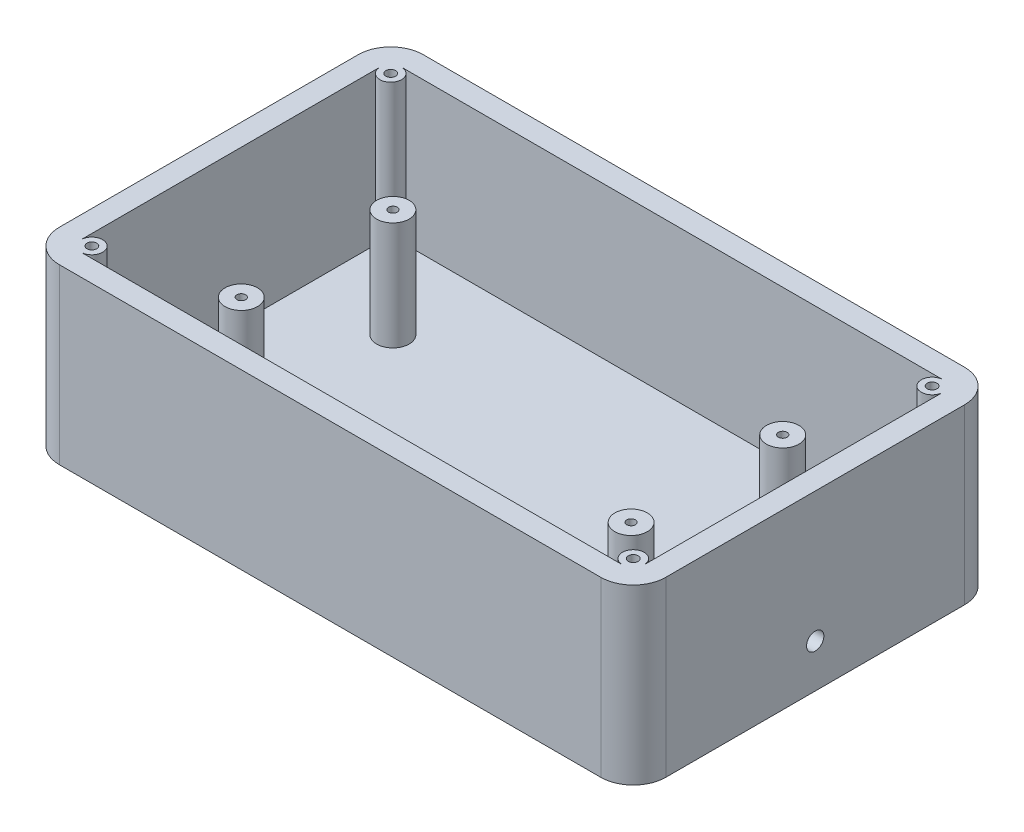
ISO-10303-21;
HEADER;
FILE_DESCRIPTION(('STEP AP214'),'2;1');
FILE_NAME('part.step','',(''),(''),'','','');
FILE_SCHEMA(('AUTOMOTIVE_DESIGN { 1 0 10303 214 1 1 1 1 }'));
ENDSEC;
DATA;
#1=APPLICATION_CONTEXT('core data for automotive mechanical design processes');
#2=APPLICATION_PROTOCOL_DEFINITION('international standard','automotive_design',2000,#1);
#3=PRODUCT_CONTEXT('',#1,'mechanical');
#4=PRODUCT('Part','Part','',(#3));
#5=PRODUCT_RELATED_PRODUCT_CATEGORY('part','',(#4));
#6=PRODUCT_DEFINITION_FORMATION('','',#4);
#7=PRODUCT_DEFINITION_CONTEXT('part definition',#1,'design');
#8=PRODUCT_DEFINITION('design','',#6,#7);
#9=PRODUCT_DEFINITION_SHAPE('','',#8);
#10=(LENGTH_UNIT() NAMED_UNIT(*) SI_UNIT(.MILLI.,.METRE.));
#11=(NAMED_UNIT(*) PLANE_ANGLE_UNIT() SI_UNIT($,.RADIAN.));
#12=(NAMED_UNIT(*) SI_UNIT($,.STERADIAN.) SOLID_ANGLE_UNIT());
#13=UNCERTAINTY_MEASURE_WITH_UNIT(LENGTH_MEASURE(1.E-05),#10,'distance_accuracy_value','');
#14=(GEOMETRIC_REPRESENTATION_CONTEXT(3) GLOBAL_UNCERTAINTY_ASSIGNED_CONTEXT((#13)) GLOBAL_UNIT_ASSIGNED_CONTEXT((#10,
#11,#12)) REPRESENTATION_CONTEXT('',''));
#15=CARTESIAN_POINT('',(0.,0.,0.));
#16=DIRECTION('',(0.,0.,1.));
#17=DIRECTION('',(1.,0.,0.));
#18=AXIS2_PLACEMENT_3D('',#15,#16,#17);
#19=CARTESIAN_POINT('',(88.9,-50.8,53.34));
#20=DIRECTION('',(1.,0.,0.));
#21=DIRECTION('',(0.,0.,-1.));
#22=AXIS2_PLACEMENT_3D('',#19,#20,#21);
#23=PLANE('',#22);
#24=CARTESIAN_POINT('',(88.9,-38.1,0.));
#25=DIRECTION('',(1.,0.,0.));
#26=DIRECTION('',(0.,0.,-1.));
#27=AXIS2_PLACEMENT_3D('',#24,#25,#26);
#28=CIRCLE('',#27,2.54);
#29=CARTESIAN_POINT('',(88.9,-38.1,-2.54));
#30=VERTEX_POINT('',#29);
#31=EDGE_CURVE('E237',#30,#30,#28,.T.);
#32=ORIENTED_EDGE('',*,*,#31,.F.);
#33=EDGE_LOOP('',(#32));
#34=FACE_BOUND('',#33,.T.);
#35=DIRECTION('',(0.,0.,-1.));
#36=VECTOR('',#35,1.);
#37=CARTESIAN_POINT('',(88.9,0.,53.34));
#38=LINE('',#37,#36);
#39=CARTESIAN_POINT('',(88.9,0.,43.815));
#40=VERTEX_POINT('',#39);
#41=CARTESIAN_POINT('',(88.9,0.,-43.815));
#42=VERTEX_POINT('',#41);
#43=EDGE_CURVE('E355',#40,#42,#38,.T.);
#44=ORIENTED_EDGE('',*,*,#43,.F.);
#45=DIRECTION('',(0.,1.,0.));
#46=VECTOR('',#45,1.);
#47=CARTESIAN_POINT('',(88.9,-50.8,43.815));
#48=LINE('',#47,#46);
#49=CARTESIAN_POINT('',(88.9,-50.8,43.815));
#50=VERTEX_POINT('',#49);
#51=EDGE_CURVE('E403',#40,#50,#48,.F.);
#52=ORIENTED_EDGE('',*,*,#51,.T.);
#53=DIRECTION('',(0.,0.,-1.));
#54=VECTOR('',#53,1.);
#55=CARTESIAN_POINT('',(88.9,-50.8,53.34));
#56=LINE('',#55,#54);
#57=CARTESIAN_POINT('',(88.9,-50.8,-43.815));
#58=VERTEX_POINT('',#57);
#59=EDGE_CURVE('E365',#50,#58,#56,.T.);
#60=ORIENTED_EDGE('',*,*,#59,.T.);
#61=DIRECTION('',(0.,1.,0.));
#62=VECTOR('',#61,1.);
#63=CARTESIAN_POINT('',(88.9,-50.8,-43.815));
#64=LINE('',#63,#62);
#65=EDGE_CURVE('E400',#58,#42,#64,.T.);
#66=ORIENTED_EDGE('',*,*,#65,.T.);
#67=EDGE_LOOP('',(#44,#52,#60,#66));
#68=FACE_BOUND('',#67,.T.);
#69=ADVANCED_FACE('F52',(#34,#68),#23,.T.);
#70=CARTESIAN_POINT('',(-88.9,-50.8,53.34));
#71=DIRECTION('',(0.,0.,1.));
#72=DIRECTION('',(1.,0.,0.));
#73=AXIS2_PLACEMENT_3D('',#70,#71,#72);
#74=PLANE('',#73);
#75=DIRECTION('',(1.,0.,0.));
#76=VECTOR('',#75,1.);
#77=CARTESIAN_POINT('',(-88.9,-50.8,53.34));
#78=LINE('',#77,#76);
#79=CARTESIAN_POINT('',(-79.375,-50.8,53.34));
#80=VERTEX_POINT('',#79);
#81=CARTESIAN_POINT('',(79.375,-50.8,53.34));
#82=VERTEX_POINT('',#81);
#83=EDGE_CURVE('E374',#80,#82,#78,.T.);
#84=ORIENTED_EDGE('',*,*,#83,.T.);
#85=DIRECTION('',(0.,1.,0.));
#86=VECTOR('',#85,1.);
#87=CARTESIAN_POINT('',(79.375,-50.8,53.34));
#88=LINE('',#87,#86);
#89=CARTESIAN_POINT('',(79.375,0.,53.34));
#90=VERTEX_POINT('',#89);
#91=EDGE_CURVE('E389',#82,#90,#88,.T.);
#92=ORIENTED_EDGE('',*,*,#91,.T.);
#93=DIRECTION('',(1.,0.,0.));
#94=VECTOR('',#93,1.);
#95=CARTESIAN_POINT('',(-88.9,0.,53.34));
#96=LINE('',#95,#94);
#97=CARTESIAN_POINT('',(-79.375,0.,53.34));
#98=VERTEX_POINT('',#97);
#99=EDGE_CURVE('E369',#98,#90,#96,.T.);
#100=ORIENTED_EDGE('',*,*,#99,.F.);
#101=DIRECTION('',(0.,1.,0.));
#102=VECTOR('',#101,1.);
#103=CARTESIAN_POINT('',(-79.375,-50.8,53.34));
#104=LINE('',#103,#102);
#105=EDGE_CURVE('E377',#98,#80,#104,.F.);
#106=ORIENTED_EDGE('',*,*,#105,.T.);
#107=EDGE_LOOP('',(#84,#92,#100,#106));
#108=FACE_BOUND('',#107,.T.);
#109=ADVANCED_FACE('F451',(#108),#74,.T.);
#110=CARTESIAN_POINT('',(-88.9,-50.8,53.34));
#111=DIRECTION('',(-1.,0.,0.));
#112=DIRECTION('',(0.,0.,1.));
#113=AXIS2_PLACEMENT_3D('',#110,#111,#112);
#114=PLANE('',#113);
#115=CARTESIAN_POINT('',(-88.9,-38.1,0.));
#116=DIRECTION('',(-1.,0.,0.));
#117=DIRECTION('',(0.,0.,1.));
#118=AXIS2_PLACEMENT_3D('',#115,#116,#117);
#119=CIRCLE('',#118,2.667);
#120=CARTESIAN_POINT('',(-88.9,-38.1,2.667));
#121=VERTEX_POINT('',#120);
#122=EDGE_CURVE('E240',#121,#121,#119,.T.);
#123=ORIENTED_EDGE('',*,*,#122,.F.);
#124=EDGE_LOOP('',(#123));
#125=FACE_BOUND('',#124,.T.);
#126=DIRECTION('',(0.,0.,1.));
#127=VECTOR('',#126,1.);
#128=CARTESIAN_POINT('',(-88.9,0.,53.34));
#129=LINE('',#128,#127);
#130=CARTESIAN_POINT('',(-88.9,0.,-43.815));
#131=VERTEX_POINT('',#130);
#132=CARTESIAN_POINT('',(-88.9,0.,43.815));
#133=VERTEX_POINT('',#132);
#134=EDGE_CURVE('E383',#131,#133,#129,.T.);
#135=ORIENTED_EDGE('',*,*,#134,.F.);
#136=DIRECTION('',(0.,1.,0.));
#137=VECTOR('',#136,1.);
#138=CARTESIAN_POINT('',(-88.9,-50.8,-43.815));
#139=LINE('',#138,#137);
#140=CARTESIAN_POINT('',(-88.9,-50.8,-43.815));
#141=VERTEX_POINT('',#140);
#142=EDGE_CURVE('E420',#131,#141,#139,.F.);
#143=ORIENTED_EDGE('',*,*,#142,.T.);
#144=DIRECTION('',(0.,0.,1.));
#145=VECTOR('',#144,1.);
#146=CARTESIAN_POINT('',(-88.9,-50.8,53.34));
#147=LINE('',#146,#145);
#148=CARTESIAN_POINT('',(-88.9,-50.8,43.815));
#149=VERTEX_POINT('',#148);
#150=EDGE_CURVE('E371',#141,#149,#147,.T.);
#151=ORIENTED_EDGE('',*,*,#150,.T.);
#152=DIRECTION('',(0.,1.,0.));
#153=VECTOR('',#152,1.);
#154=CARTESIAN_POINT('',(-88.9,-50.8,43.815));
#155=LINE('',#154,#153);
#156=EDGE_CURVE('E417',#149,#133,#155,.T.);
#157=ORIENTED_EDGE('',*,*,#156,.T.);
#158=EDGE_LOOP('',(#135,#143,#151,#157));
#159=FACE_BOUND('',#158,.T.);
#160=ADVANCED_FACE('F457',(#125,#159),#114,.T.);
#161=CARTESIAN_POINT('',(-88.9,-50.8,-53.34));
#162=DIRECTION('',(0.,0.,-1.));
#163=DIRECTION('',(-1.,0.,0.));
#164=AXIS2_PLACEMENT_3D('',#161,#162,#163);
#165=PLANE('',#164);
#166=DIRECTION('',(-1.,0.,0.));
#167=VECTOR('',#166,1.);
#168=CARTESIAN_POINT('',(-88.9,0.,-53.34));
#169=LINE('',#168,#167);
#170=CARTESIAN_POINT('',(79.375,0.,-53.34));
#171=VERTEX_POINT('',#170);
#172=CARTESIAN_POINT('',(-79.375,0.,-53.34));
#173=VERTEX_POINT('',#172);
#174=EDGE_CURVE('E380',#171,#173,#169,.T.);
#175=ORIENTED_EDGE('',*,*,#174,.F.);
#176=DIRECTION('',(0.,1.,0.));
#177=VECTOR('',#176,1.);
#178=CARTESIAN_POINT('',(79.375,-50.8,-53.34));
#179=LINE('',#178,#177);
#180=CARTESIAN_POINT('',(79.375,-50.8,-53.34));
#181=VERTEX_POINT('',#180);
#182=EDGE_CURVE('E415',#171,#181,#179,.F.);
#183=ORIENTED_EDGE('',*,*,#182,.T.);
#184=DIRECTION('',(-1.,0.,0.));
#185=VECTOR('',#184,1.);
#186=CARTESIAN_POINT('',(-88.9,-50.8,-53.34));
#187=LINE('',#186,#185);
#188=CARTESIAN_POINT('',(-79.375,-50.8,-53.34));
#189=VERTEX_POINT('',#188);
#190=EDGE_CURVE('E368',#181,#189,#187,.T.);
#191=ORIENTED_EDGE('',*,*,#190,.T.);
#192=DIRECTION('',(0.,1.,0.));
#193=VECTOR('',#192,1.);
#194=CARTESIAN_POINT('',(-79.375,-50.8,-53.34));
#195=LINE('',#194,#193);
#196=EDGE_CURVE('E412',#189,#173,#195,.T.);
#197=ORIENTED_EDGE('',*,*,#196,.T.);
#198=EDGE_LOOP('',(#175,#183,#191,#197));
#199=FACE_BOUND('',#198,.T.);
#200=ADVANCED_FACE('F464',(#199),#165,.T.);
#201=CARTESIAN_POINT('',(0.,-50.8,0.));
#202=DIRECTION('',(0.,-1.,0.));
#203=DIRECTION('',(0.,0.,-1.));
#204=AXIS2_PLACEMENT_3D('',#201,#202,#203);
#205=PLANE('',#204);
#206=CARTESIAN_POINT('',(-57.15,-50.8,-22.225));
#207=DIRECTION('',(0.,-1.,0.));
#208=DIRECTION('',(0.,0.,-1.));
#209=AXIS2_PLACEMENT_3D('',#206,#207,#208);
#210=CIRCLE('',#209,1.26999999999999);
#211=CARTESIAN_POINT('',(-57.15,-50.8,-23.495));
#212=VERTEX_POINT('',#211);
#213=EDGE_CURVE('E215',#212,#212,#210,.T.);
#214=ORIENTED_EDGE('',*,*,#213,.F.);
#215=EDGE_LOOP('',(#214));
#216=FACE_BOUND('',#215,.T.);
#217=CARTESIAN_POINT('',(-57.15,-50.8,22.225));
#218=DIRECTION('',(0.,-1.,0.));
#219=DIRECTION('',(0.,0.,-1.));
#220=AXIS2_PLACEMENT_3D('',#217,#218,#219);
#221=CIRCLE('',#220,1.26999999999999);
#222=CARTESIAN_POINT('',(-57.15,-50.8,20.955));
#223=VERTEX_POINT('',#222);
#224=EDGE_CURVE('E214',#223,#223,#221,.T.);
#225=ORIENTED_EDGE('',*,*,#224,.F.);
#226=EDGE_LOOP('',(#225));
#227=FACE_BOUND('',#226,.T.);
#228=CARTESIAN_POINT('',(57.15,-50.8,22.225));
#229=DIRECTION('',(0.,-1.,0.));
#230=DIRECTION('',(0.,0.,-1.));
#231=AXIS2_PLACEMENT_3D('',#228,#229,#230);
#232=CIRCLE('',#231,1.26999999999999);
#233=CARTESIAN_POINT('',(57.15,-50.8,20.955));
#234=VERTEX_POINT('',#233);
#235=EDGE_CURVE('E225',#234,#234,#232,.T.);
#236=ORIENTED_EDGE('',*,*,#235,.F.);
#237=EDGE_LOOP('',(#236));
#238=FACE_BOUND('',#237,.T.);
#239=CARTESIAN_POINT('',(57.15,-50.8,-22.225));
#240=DIRECTION('',(0.,-1.,0.));
#241=DIRECTION('',(0.,0.,-1.));
#242=AXIS2_PLACEMENT_3D('',#239,#240,#241);
#243=CIRCLE('',#242,1.26999999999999);
#244=CARTESIAN_POINT('',(57.15,-50.8,-23.495));
#245=VERTEX_POINT('',#244);
#246=EDGE_CURVE('E231',#245,#245,#243,.T.);
#247=ORIENTED_EDGE('',*,*,#246,.F.);
#248=EDGE_LOOP('',(#247));
#249=FACE_BOUND('',#248,.T.);
#250=ORIENTED_EDGE('',*,*,#59,.F.);
#251=CARTESIAN_POINT('',(79.375,-50.8,43.815));
#252=DIRECTION('',(0.,-1.,0.));
#253=DIRECTION('',(0.,0.,-1.));
#254=AXIS2_PLACEMENT_3D('',#251,#252,#253);
#255=CIRCLE('',#254,9.525);
#256=EDGE_CURVE('E410',#50,#82,#255,.T.);
#257=ORIENTED_EDGE('',*,*,#256,.T.);
#258=ORIENTED_EDGE('',*,*,#83,.F.);
#259=CARTESIAN_POINT('',(-79.375,-50.8,43.815));
#260=DIRECTION('',(0.,-1.,0.));
#261=DIRECTION('',(0.,0.,-1.));
#262=AXIS2_PLACEMENT_3D('',#259,#260,#261);
#263=CIRCLE('',#262,9.525);
#264=EDGE_CURVE('E405',#80,#149,#263,.T.);
#265=ORIENTED_EDGE('',*,*,#264,.T.);
#266=ORIENTED_EDGE('',*,*,#150,.F.);
#267=CARTESIAN_POINT('',(-79.375,-50.8,-43.815));
#268=DIRECTION('',(0.,-1.,0.));
#269=DIRECTION('',(0.,0.,-1.));
#270=AXIS2_PLACEMENT_3D('',#267,#268,#269);
#271=CIRCLE('',#270,9.525);
#272=EDGE_CURVE('E77',#141,#189,#271,.T.);
#273=ORIENTED_EDGE('',*,*,#272,.T.);
#274=ORIENTED_EDGE('',*,*,#190,.F.);
#275=CARTESIAN_POINT('',(79.375,-50.8,-43.815));
#276=DIRECTION('',(0.,-1.,0.));
#277=DIRECTION('',(0.,0.,-1.));
#278=AXIS2_PLACEMENT_3D('',#275,#276,#277);
#279=CIRCLE('',#278,9.525);
#280=EDGE_CURVE('E408',#181,#58,#279,.T.);
#281=ORIENTED_EDGE('',*,*,#280,.T.);
#282=EDGE_LOOP('',(#250,#257,#258,#265,#266,#273,#274,#281));
#283=FACE_BOUND('',#282,.T.);
#284=ADVANCED_FACE('F495',(#216,#227,#238,#249,#283),#205,.T.);
#285=CARTESIAN_POINT('',(0.,0.,0.));
#286=DIRECTION('',(0.,-1.,0.));
#287=DIRECTION('',(0.,0.,-1.));
#288=AXIS2_PLACEMENT_3D('',#285,#286,#287);
#289=PLANE('',#288);
#290=CARTESIAN_POINT('',(-79.375,0.,-43.815));
#291=DIRECTION('',(0.,1.,0.));
#292=DIRECTION('',(0.,0.,1.));
#293=AXIS2_PLACEMENT_3D('',#290,#291,#292);
#294=CIRCLE('',#293,1.43509999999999);
#295=CARTESIAN_POINT('',(-79.375,0.,-42.3799));
#296=VERTEX_POINT('',#295);
#297=EDGE_CURVE('E280',#296,#296,#294,.T.);
#298=ORIENTED_EDGE('',*,*,#297,.F.);
#299=EDGE_LOOP('',(#298));
#300=FACE_BOUND('',#299,.T.);
#301=CARTESIAN_POINT('',(-79.375,0.,43.815));
#302=DIRECTION('',(0.,1.,0.));
#303=DIRECTION('',(0.,0.,1.));
#304=AXIS2_PLACEMENT_3D('',#301,#302,#303);
#305=CIRCLE('',#304,1.43509999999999);
#306=CARTESIAN_POINT('',(-79.375,0.,45.2501));
#307=VERTEX_POINT('',#306);
#308=EDGE_CURVE('E286',#307,#307,#305,.T.);
#309=ORIENTED_EDGE('',*,*,#308,.F.);
#310=EDGE_LOOP('',(#309));
#311=FACE_BOUND('',#310,.T.);
#312=CARTESIAN_POINT('',(79.375,0.,43.815));
#313=DIRECTION('',(0.,1.,0.));
#314=DIRECTION('',(0.,0.,1.));
#315=AXIS2_PLACEMENT_3D('',#312,#313,#314);
#316=CIRCLE('',#315,1.43509999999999);
#317=CARTESIAN_POINT('',(79.375,0.,45.2501));
#318=VERTEX_POINT('',#317);
#319=EDGE_CURVE('E292',#318,#318,#316,.T.);
#320=ORIENTED_EDGE('',*,*,#319,.F.);
#321=EDGE_LOOP('',(#320));
#322=FACE_BOUND('',#321,.T.);
#323=CARTESIAN_POINT('',(79.375,0.,-43.815));
#324=DIRECTION('',(0.,1.,0.));
#325=DIRECTION('',(0.,0.,1.));
#326=AXIS2_PLACEMENT_3D('',#323,#324,#325);
#327=CIRCLE('',#326,1.43509999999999);
#328=CARTESIAN_POINT('',(79.375,0.,-42.3799));
#329=VERTEX_POINT('',#328);
#330=EDGE_CURVE('E298',#329,#329,#327,.T.);
#331=ORIENTED_EDGE('',*,*,#330,.F.);
#332=EDGE_LOOP('',(#331));
#333=FACE_BOUND('',#332,.T.);
#334=DIRECTION('',(1.,0.,0.));
#335=VECTOR('',#334,1.);
#336=CARTESIAN_POINT('',(-88.9,0.,46.99));
#337=LINE('',#336,#335);
#338=CARTESIAN_POINT('',(-79.375,0.,46.99));
#339=VERTEX_POINT('',#338);
#340=CARTESIAN_POINT('',(79.375,0.,46.99));
#341=VERTEX_POINT('',#340);
#342=EDGE_CURVE('E335',#339,#341,#337,.T.);
#343=ORIENTED_EDGE('',*,*,#342,.F.);
#344=CARTESIAN_POINT('',(-79.375,0.,43.815));
#345=DIRECTION('',(0.,-1.,0.));
#346=DIRECTION('',(0.,0.,-1.));
#347=AXIS2_PLACEMENT_3D('',#344,#345,#346);
#348=CIRCLE('',#347,3.175);
#349=CARTESIAN_POINT('',(-82.55,0.,43.815));
#350=VERTEX_POINT('',#349);
#351=EDGE_CURVE('E306',#339,#350,#348,.F.);
#352=ORIENTED_EDGE('',*,*,#351,.T.);
#353=DIRECTION('',(0.,0.,1.));
#354=VECTOR('',#353,1.);
#355=CARTESIAN_POINT('',(-82.55,0.,53.34));
#356=LINE('',#355,#354);
#357=CARTESIAN_POINT('',(-82.55,0.,-43.815));
#358=VERTEX_POINT('',#357);
#359=EDGE_CURVE('E69',#358,#350,#356,.T.);
#360=ORIENTED_EDGE('',*,*,#359,.F.);
#361=CARTESIAN_POINT('',(-79.375,0.,-43.815));
#362=DIRECTION('',(0.,-1.,0.));
#363=DIRECTION('',(0.,0.,-1.));
#364=AXIS2_PLACEMENT_3D('',#361,#362,#363);
#365=CIRCLE('',#364,3.175);
#366=CARTESIAN_POINT('',(-79.375,0.,-46.99));
#367=VERTEX_POINT('',#366);
#368=EDGE_CURVE('E323',#367,#358,#365,.T.);
#369=ORIENTED_EDGE('',*,*,#368,.F.);
#370=DIRECTION('',(-1.,0.,0.));
#371=VECTOR('',#370,1.);
#372=CARTESIAN_POINT('',(-88.9,0.,-46.99));
#373=LINE('',#372,#371);
#374=CARTESIAN_POINT('',(79.375,0.,-46.99));
#375=VERTEX_POINT('',#374);
#376=EDGE_CURVE('E361',#375,#367,#373,.T.);
#377=ORIENTED_EDGE('',*,*,#376,.F.);
#378=CARTESIAN_POINT('',(79.375,0.,-43.815));
#379=DIRECTION('',(0.,-1.,0.));
#380=DIRECTION('',(0.,0.,-1.));
#381=AXIS2_PLACEMENT_3D('',#378,#379,#380);
#382=CIRCLE('',#381,3.175);
#383=CARTESIAN_POINT('',(82.55,0.,-43.815));
#384=VERTEX_POINT('',#383);
#385=EDGE_CURVE('E317',#375,#384,#382,.F.);
#386=ORIENTED_EDGE('',*,*,#385,.T.);
#387=DIRECTION('',(0.,0.,-1.));
#388=VECTOR('',#387,1.);
#389=CARTESIAN_POINT('',(82.55,0.,53.34));
#390=LINE('',#389,#388);
#391=CARTESIAN_POINT('',(82.55,0.,43.815));
#392=VERTEX_POINT('',#391);
#393=EDGE_CURVE('E326',#392,#384,#390,.T.);
#394=ORIENTED_EDGE('',*,*,#393,.F.);
#395=CARTESIAN_POINT('',(79.375,0.,43.815));
#396=DIRECTION('',(0.,-1.,0.));
#397=DIRECTION('',(0.,0.,-1.));
#398=AXIS2_PLACEMENT_3D('',#395,#396,#397);
#399=CIRCLE('',#398,3.175);
#400=EDGE_CURVE('E312',#341,#392,#399,.T.);
#401=ORIENTED_EDGE('',*,*,#400,.F.);
#402=EDGE_LOOP('',(#343,#352,#360,#369,#377,#386,#394,#401));
#403=FACE_BOUND('',#402,.T.);
#404=ORIENTED_EDGE('',*,*,#99,.T.);
#405=CARTESIAN_POINT('',(79.375,0.,43.815));
#406=DIRECTION('',(0.,-1.,0.));
#407=DIRECTION('',(0.,0.,-1.));
#408=AXIS2_PLACEMENT_3D('',#405,#406,#407);
#409=CIRCLE('',#408,9.525);
#410=EDGE_CURVE('E398',#90,#40,#409,.F.);
#411=ORIENTED_EDGE('',*,*,#410,.T.);
#412=ORIENTED_EDGE('',*,*,#43,.T.);
#413=CARTESIAN_POINT('',(79.375,0.,-43.815));
#414=DIRECTION('',(0.,-1.,0.));
#415=DIRECTION('',(0.,0.,-1.));
#416=AXIS2_PLACEMENT_3D('',#413,#414,#415);
#417=CIRCLE('',#416,9.525);
#418=EDGE_CURVE('E396',#42,#171,#417,.F.);
#419=ORIENTED_EDGE('',*,*,#418,.T.);
#420=ORIENTED_EDGE('',*,*,#174,.T.);
#421=CARTESIAN_POINT('',(-79.375,0.,-43.815));
#422=DIRECTION('',(0.,-1.,0.));
#423=DIRECTION('',(0.,0.,-1.));
#424=AXIS2_PLACEMENT_3D('',#421,#422,#423);
#425=CIRCLE('',#424,9.525);
#426=EDGE_CURVE('E394',#173,#131,#425,.F.);
#427=ORIENTED_EDGE('',*,*,#426,.T.);
#428=ORIENTED_EDGE('',*,*,#134,.T.);
#429=CARTESIAN_POINT('',(-79.375,0.,43.815));
#430=DIRECTION('',(0.,-1.,0.));
#431=DIRECTION('',(0.,0.,-1.));
#432=AXIS2_PLACEMENT_3D('',#429,#430,#431);
#433=CIRCLE('',#432,9.525);
#434=EDGE_CURVE('E392',#133,#98,#433,.F.);
#435=ORIENTED_EDGE('',*,*,#434,.T.);
#436=EDGE_LOOP('',(#404,#411,#412,#419,#420,#427,#428,#435));
#437=FACE_BOUND('',#436,.T.);
#438=ADVANCED_FACE('F470',(#300,#311,#322,#333,#403,#437),#289,.F.);
#439=CARTESIAN_POINT('',(79.375,-50.8,43.815));
#440=DIRECTION('',(0.,1.,0.));
#441=DIRECTION('',(0.,0.,1.));
#442=AXIS2_PLACEMENT_3D('',#439,#440,#441);
#443=CYLINDRICAL_SURFACE('',#442,9.525);
#444=ORIENTED_EDGE('',*,*,#256,.F.);
#445=ORIENTED_EDGE('',*,*,#51,.F.);
#446=ORIENTED_EDGE('',*,*,#410,.F.);
#447=ORIENTED_EDGE('',*,*,#91,.F.);
#448=EDGE_LOOP('',(#444,#445,#446,#447));
#449=FACE_BOUND('',#448,.T.);
#450=ADVANCED_FACE('F466',(#449),#443,.T.);
#451=CARTESIAN_POINT('',(79.375,-50.8,-43.815));
#452=DIRECTION('',(0.,1.,0.));
#453=DIRECTION('',(0.,0.,1.));
#454=AXIS2_PLACEMENT_3D('',#451,#452,#453);
#455=CYLINDRICAL_SURFACE('',#454,9.525);
#456=ORIENTED_EDGE('',*,*,#280,.F.);
#457=ORIENTED_EDGE('',*,*,#182,.F.);
#458=ORIENTED_EDGE('',*,*,#418,.F.);
#459=ORIENTED_EDGE('',*,*,#65,.F.);
#460=EDGE_LOOP('',(#456,#457,#458,#459));
#461=FACE_BOUND('',#460,.T.);
#462=ADVANCED_FACE('F469',(#461),#455,.T.);
#463=CARTESIAN_POINT('',(-79.375,-50.8,-43.815));
#464=DIRECTION('',(0.,1.,0.));
#465=DIRECTION('',(0.,0.,1.));
#466=AXIS2_PLACEMENT_3D('',#463,#464,#465);
#467=CYLINDRICAL_SURFACE('',#466,9.525);
#468=ORIENTED_EDGE('',*,*,#272,.F.);
#469=ORIENTED_EDGE('',*,*,#142,.F.);
#470=ORIENTED_EDGE('',*,*,#426,.F.);
#471=ORIENTED_EDGE('',*,*,#196,.F.);
#472=EDGE_LOOP('',(#468,#469,#470,#471));
#473=FACE_BOUND('',#472,.T.);
#474=ADVANCED_FACE('F473',(#473),#467,.T.);
#475=CARTESIAN_POINT('',(-79.375,-50.8,43.815));
#476=DIRECTION('',(0.,1.,0.));
#477=DIRECTION('',(0.,0.,1.));
#478=AXIS2_PLACEMENT_3D('',#475,#476,#477);
#479=CYLINDRICAL_SURFACE('',#478,9.525);
#480=ORIENTED_EDGE('',*,*,#264,.F.);
#481=ORIENTED_EDGE('',*,*,#105,.F.);
#482=ORIENTED_EDGE('',*,*,#434,.F.);
#483=ORIENTED_EDGE('',*,*,#156,.F.);
#484=EDGE_LOOP('',(#480,#481,#482,#483));
#485=FACE_BOUND('',#484,.T.);
#486=ADVANCED_FACE('F54',(#485),#479,.T.);
#487=CARTESIAN_POINT('',(82.55,-50.8,53.34));
#488=DIRECTION('',(1.,0.,0.));
#489=DIRECTION('',(0.,0.,-1.));
#490=AXIS2_PLACEMENT_3D('',#487,#488,#489);
#491=PLANE('',#490);
#492=CARTESIAN_POINT('',(82.55,-38.1,0.));
#493=DIRECTION('',(1.,0.,0.));
#494=DIRECTION('',(0.,0.,-1.));
#495=AXIS2_PLACEMENT_3D('',#492,#493,#494);
#496=CIRCLE('',#495,2.54);
#497=CARTESIAN_POINT('',(82.55,-38.1,-2.54));
#498=VERTEX_POINT('',#497);
#499=EDGE_CURVE('E56',#498,#498,#496,.T.);
#500=ORIENTED_EDGE('',*,*,#499,.T.);
#501=EDGE_LOOP('',(#500));
#502=FACE_BOUND('',#501,.T.);
#503=ORIENTED_EDGE('',*,*,#393,.T.);
#504=DIRECTION('',(0.,1.,0.));
#505=VECTOR('',#504,1.);
#506=CARTESIAN_POINT('',(82.55,-50.8,-43.815));
#507=LINE('',#506,#505);
#508=CARTESIAN_POINT('',(82.55,-44.45,-43.815));
#509=VERTEX_POINT('',#508);
#510=EDGE_CURVE('E331',#509,#384,#507,.T.);
#511=ORIENTED_EDGE('',*,*,#510,.F.);
#512=DIRECTION('',(0.,0.,-1.));
#513=VECTOR('',#512,1.);
#514=CARTESIAN_POINT('',(82.55,-44.45,53.34));
#515=LINE('',#514,#513);
#516=CARTESIAN_POINT('',(82.55,-44.45,43.815));
#517=VERTEX_POINT('',#516);
#518=EDGE_CURVE('E332',#517,#509,#515,.T.);
#519=ORIENTED_EDGE('',*,*,#518,.F.);
#520=DIRECTION('',(0.,1.,0.));
#521=VECTOR('',#520,1.);
#522=CARTESIAN_POINT('',(82.55,-50.8,43.815));
#523=LINE('',#522,#521);
#524=EDGE_CURVE('E327',#392,#517,#523,.F.);
#525=ORIENTED_EDGE('',*,*,#524,.F.);
#526=EDGE_LOOP('',(#503,#511,#519,#525));
#527=FACE_BOUND('',#526,.T.);
#528=ADVANCED_FACE('F480',(#502,#527),#491,.F.);
#529=CARTESIAN_POINT('',(-88.9,-50.8,46.99));
#530=DIRECTION('',(0.,0.,1.));
#531=DIRECTION('',(1.,0.,0.));
#532=AXIS2_PLACEMENT_3D('',#529,#530,#531);
#533=PLANE('',#532);
#534=DIRECTION('',(1.,0.,0.));
#535=VECTOR('',#534,1.);
#536=CARTESIAN_POINT('',(-88.9,-44.45,46.99));
#537=LINE('',#536,#535);
#538=CARTESIAN_POINT('',(-79.375,-44.45,46.99));
#539=VERTEX_POINT('',#538);
#540=CARTESIAN_POINT('',(79.375,-44.45,46.99));
#541=VERTEX_POINT('',#540);
#542=EDGE_CURVE('E339',#539,#541,#537,.T.);
#543=ORIENTED_EDGE('',*,*,#542,.F.);
#544=DIRECTION('',(0.,1.,0.));
#545=VECTOR('',#544,1.);
#546=CARTESIAN_POINT('',(-79.375,-50.8,46.99));
#547=LINE('',#546,#545);
#548=EDGE_CURVE('E341',#339,#539,#547,.F.);
#549=ORIENTED_EDGE('',*,*,#548,.F.);
#550=ORIENTED_EDGE('',*,*,#342,.T.);
#551=DIRECTION('',(0.,1.,0.));
#552=VECTOR('',#551,1.);
#553=CARTESIAN_POINT('',(79.375,-50.8,46.99));
#554=LINE('',#553,#552);
#555=EDGE_CURVE('E338',#541,#341,#554,.T.);
#556=ORIENTED_EDGE('',*,*,#555,.F.);
#557=EDGE_LOOP('',(#543,#549,#550,#556));
#558=FACE_BOUND('',#557,.T.);
#559=ADVANCED_FACE('F527',(#558),#533,.F.);
#560=CARTESIAN_POINT('',(-82.55,-50.8,53.34));
#561=DIRECTION('',(-1.,0.,0.));
#562=DIRECTION('',(0.,0.,1.));
#563=AXIS2_PLACEMENT_3D('',#560,#561,#562);
#564=PLANE('',#563);
#565=CARTESIAN_POINT('',(-82.55,-38.1,0.));
#566=DIRECTION('',(-1.,0.,0.));
#567=DIRECTION('',(0.,0.,1.));
#568=AXIS2_PLACEMENT_3D('',#565,#566,#567);
#569=CIRCLE('',#568,2.667);
#570=CARTESIAN_POINT('',(-82.55,-38.1,2.667));
#571=VERTEX_POINT('',#570);
#572=EDGE_CURVE('E243',#571,#571,#569,.T.);
#573=ORIENTED_EDGE('',*,*,#572,.T.);
#574=EDGE_LOOP('',(#573));
#575=FACE_BOUND('',#574,.T.);
#576=ORIENTED_EDGE('',*,*,#359,.T.);
#577=DIRECTION('',(0.,1.,0.));
#578=VECTOR('',#577,1.);
#579=CARTESIAN_POINT('',(-82.55,-50.8,43.815));
#580=LINE('',#579,#578);
#581=CARTESIAN_POINT('',(-82.55,-44.45,43.815));
#582=VERTEX_POINT('',#581);
#583=EDGE_CURVE('E349',#582,#350,#580,.T.);
#584=ORIENTED_EDGE('',*,*,#583,.F.);
#585=DIRECTION('',(0.,0.,1.));
#586=VECTOR('',#585,1.);
#587=CARTESIAN_POINT('',(-82.55,-44.45,53.34));
#588=LINE('',#587,#586);
#589=CARTESIAN_POINT('',(-82.55,-44.45,-43.815));
#590=VERTEX_POINT('',#589);
#591=EDGE_CURVE('E342',#590,#582,#588,.T.);
#592=ORIENTED_EDGE('',*,*,#591,.F.);
#593=DIRECTION('',(0.,1.,0.));
#594=VECTOR('',#593,1.);
#595=CARTESIAN_POINT('',(-82.55,-50.8,-43.815));
#596=LINE('',#595,#594);
#597=EDGE_CURVE('E351',#358,#590,#596,.F.);
#598=ORIENTED_EDGE('',*,*,#597,.F.);
#599=EDGE_LOOP('',(#576,#584,#592,#598));
#600=FACE_BOUND('',#599,.T.);
#601=ADVANCED_FACE('F432',(#575,#600),#564,.F.);
#602=CARTESIAN_POINT('',(-88.9,-50.8,-46.99));
#603=DIRECTION('',(0.,0.,-1.));
#604=DIRECTION('',(-1.,0.,0.));
#605=AXIS2_PLACEMENT_3D('',#602,#603,#604);
#606=PLANE('',#605);
#607=ORIENTED_EDGE('',*,*,#376,.T.);
#608=DIRECTION('',(0.,1.,0.));
#609=VECTOR('',#608,1.);
#610=CARTESIAN_POINT('',(-79.375,-50.8,-46.99));
#611=LINE('',#610,#609);
#612=CARTESIAN_POINT('',(-79.375,-44.45,-46.99));
#613=VERTEX_POINT('',#612);
#614=EDGE_CURVE('E330',#613,#367,#611,.T.);
#615=ORIENTED_EDGE('',*,*,#614,.F.);
#616=DIRECTION('',(-1.,0.,0.));
#617=VECTOR('',#616,1.);
#618=CARTESIAN_POINT('',(-88.9,-44.45,-46.99));
#619=LINE('',#618,#617);
#620=CARTESIAN_POINT('',(79.375,-44.45,-46.99));
#621=VERTEX_POINT('',#620);
#622=EDGE_CURVE('E334',#621,#613,#619,.T.);
#623=ORIENTED_EDGE('',*,*,#622,.F.);
#624=DIRECTION('',(0.,1.,0.));
#625=VECTOR('',#624,1.);
#626=CARTESIAN_POINT('',(79.375,-50.8,-46.99));
#627=LINE('',#626,#625);
#628=EDGE_CURVE('E352',#375,#621,#627,.F.);
#629=ORIENTED_EDGE('',*,*,#628,.F.);
#630=EDGE_LOOP('',(#607,#615,#623,#629));
#631=FACE_BOUND('',#630,.T.);
#632=ADVANCED_FACE('F520',(#631),#606,.F.);
#633=CARTESIAN_POINT('',(0.,-44.45,0.));
#634=DIRECTION('',(0.,-1.,0.));
#635=DIRECTION('',(0.,0.,-1.));
#636=AXIS2_PLACEMENT_3D('',#633,#634,#635);
#637=PLANE('',#636);
#638=CARTESIAN_POINT('',(57.15,-44.45,22.225));
#639=DIRECTION('',(0.,-1.,0.));
#640=DIRECTION('',(0.,0.,-1.));
#641=AXIS2_PLACEMENT_3D('',#638,#639,#640);
#642=CIRCLE('',#641,4.7625);
#643=CARTESIAN_POINT('',(57.15,-44.45,17.4625));
#644=VERTEX_POINT('',#643);
#645=EDGE_CURVE('E14',#644,#644,#642,.F.);
#646=ORIENTED_EDGE('',*,*,#645,.F.);
#647=EDGE_LOOP('',(#646));
#648=FACE_BOUND('',#647,.T.);
#649=CARTESIAN_POINT('',(-57.15,-44.45,22.225));
#650=DIRECTION('',(0.,-1.,0.));
#651=DIRECTION('',(0.,0.,-1.));
#652=AXIS2_PLACEMENT_3D('',#649,#650,#651);
#653=CIRCLE('',#652,4.7625);
#654=CARTESIAN_POINT('',(-57.15,-44.45,17.4625));
#655=VERTEX_POINT('',#654);
#656=EDGE_CURVE('E61',#655,#655,#653,.F.);
#657=ORIENTED_EDGE('',*,*,#656,.F.);
#658=EDGE_LOOP('',(#657));
#659=FACE_BOUND('',#658,.T.);
#660=CARTESIAN_POINT('',(-57.15,-44.45,-22.225));
#661=DIRECTION('',(0.,-1.,0.));
#662=DIRECTION('',(0.,0.,-1.));
#663=AXIS2_PLACEMENT_3D('',#660,#661,#662);
#664=CIRCLE('',#663,4.7625);
#665=CARTESIAN_POINT('',(-57.15,-44.45,-26.9875));
#666=VERTEX_POINT('',#665);
#667=EDGE_CURVE('E425',#666,#666,#664,.F.);
#668=ORIENTED_EDGE('',*,*,#667,.F.);
#669=EDGE_LOOP('',(#668));
#670=FACE_BOUND('',#669,.T.);
#671=CARTESIAN_POINT('',(57.15,-44.45,-22.225));
#672=DIRECTION('',(0.,-1.,0.));
#673=DIRECTION('',(0.,0.,-1.));
#674=AXIS2_PLACEMENT_3D('',#671,#672,#673);
#675=CIRCLE('',#674,4.7625);
#676=CARTESIAN_POINT('',(57.15,-44.45,-26.9875));
#677=VERTEX_POINT('',#676);
#678=EDGE_CURVE('E422',#677,#677,#675,.F.);
#679=ORIENTED_EDGE('',*,*,#678,.F.);
#680=EDGE_LOOP('',(#679));
#681=FACE_BOUND('',#680,.T.);
#682=ORIENTED_EDGE('',*,*,#591,.T.);
#683=CARTESIAN_POINT('',(-79.375,-44.45,43.815));
#684=DIRECTION('',(0.,-1.,0.));
#685=DIRECTION('',(0.,0.,-1.));
#686=AXIS2_PLACEMENT_3D('',#683,#684,#685);
#687=CIRCLE('',#686,3.175);
#688=EDGE_CURVE('E304',#582,#539,#687,.T.);
#689=ORIENTED_EDGE('',*,*,#688,.T.);
#690=ORIENTED_EDGE('',*,*,#542,.T.);
#691=CARTESIAN_POINT('',(79.375,-44.45,43.815));
#692=DIRECTION('',(0.,1.,0.));
#693=DIRECTION('',(0.,0.,-1.));
#694=AXIS2_PLACEMENT_3D('',#691,#692,#693);
#695=CIRCLE('',#694,3.175);
#696=EDGE_CURVE('E309',#517,#541,#695,.T.);
#697=ORIENTED_EDGE('',*,*,#696,.F.);
#698=ORIENTED_EDGE('',*,*,#518,.T.);
#699=CARTESIAN_POINT('',(79.375,-44.45,-43.815));
#700=DIRECTION('',(0.,-1.,0.));
#701=DIRECTION('',(0.,0.,1.));
#702=AXIS2_PLACEMENT_3D('',#699,#700,#701);
#703=CIRCLE('',#702,3.175);
#704=EDGE_CURVE('E315',#509,#621,#703,.T.);
#705=ORIENTED_EDGE('',*,*,#704,.T.);
#706=ORIENTED_EDGE('',*,*,#622,.T.);
#707=CARTESIAN_POINT('',(-79.375,-44.45,-43.815));
#708=DIRECTION('',(0.,1.,0.));
#709=DIRECTION('',(0.,0.,1.));
#710=AXIS2_PLACEMENT_3D('',#707,#708,#709);
#711=CIRCLE('',#710,3.175);
#712=EDGE_CURVE('E320',#590,#613,#711,.T.);
#713=ORIENTED_EDGE('',*,*,#712,.F.);
#714=EDGE_LOOP('',(#682,#689,#690,#697,#698,#705,#706,#713));
#715=FACE_BOUND('',#714,.T.);
#716=ADVANCED_FACE('F516',(#648,#659,#670,#681,#715),#637,.F.);
#717=CARTESIAN_POINT('',(-79.375,8.98025612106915,-43.815));
#718=DIRECTION('',(0.,-1.,0.));
#719=DIRECTION('',(0.,0.,-1.));
#720=AXIS2_PLACEMENT_3D('',#717,#718,#719);
#721=CYLINDRICAL_SURFACE('',#720,3.175);
#722=ORIENTED_EDGE('',*,*,#597,.T.);
#723=ORIENTED_EDGE('',*,*,#712,.T.);
#724=ORIENTED_EDGE('',*,*,#614,.T.);
#725=ORIENTED_EDGE('',*,*,#368,.T.);
#726=EDGE_LOOP('',(#722,#723,#724,#725));
#727=FACE_BOUND('',#726,.T.);
#728=ADVANCED_FACE('F519',(#727),#721,.T.);
#729=CARTESIAN_POINT('',(79.375,8.98025612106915,-43.815));
#730=DIRECTION('',(0.,-1.,0.));
#731=DIRECTION('',(0.,0.,-1.));
#732=AXIS2_PLACEMENT_3D('',#729,#730,#731);
#733=CYLINDRICAL_SURFACE('',#732,3.175);
#734=ORIENTED_EDGE('',*,*,#510,.T.);
#735=ORIENTED_EDGE('',*,*,#385,.F.);
#736=ORIENTED_EDGE('',*,*,#628,.T.);
#737=ORIENTED_EDGE('',*,*,#704,.F.);
#738=EDGE_LOOP('',(#734,#735,#736,#737));
#739=FACE_BOUND('',#738,.T.);
#740=ADVANCED_FACE('F536',(#739),#733,.T.);
#741=CARTESIAN_POINT('',(79.375,8.98025612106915,43.815));
#742=DIRECTION('',(0.,-1.,0.));
#743=DIRECTION('',(0.,0.,-1.));
#744=AXIS2_PLACEMENT_3D('',#741,#742,#743);
#745=CYLINDRICAL_SURFACE('',#744,3.175);
#746=ORIENTED_EDGE('',*,*,#524,.T.);
#747=ORIENTED_EDGE('',*,*,#696,.T.);
#748=ORIENTED_EDGE('',*,*,#555,.T.);
#749=ORIENTED_EDGE('',*,*,#400,.T.);
#750=EDGE_LOOP('',(#746,#747,#748,#749));
#751=FACE_BOUND('',#750,.T.);
#752=ADVANCED_FACE('F540',(#751),#745,.T.);
#753=CARTESIAN_POINT('',(-79.375,8.98025612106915,43.815));
#754=DIRECTION('',(0.,-1.,0.));
#755=DIRECTION('',(0.,0.,-1.));
#756=AXIS2_PLACEMENT_3D('',#753,#754,#755);
#757=CYLINDRICAL_SURFACE('',#756,3.175);
#758=ORIENTED_EDGE('',*,*,#351,.F.);
#759=ORIENTED_EDGE('',*,*,#548,.T.);
#760=ORIENTED_EDGE('',*,*,#688,.F.);
#761=ORIENTED_EDGE('',*,*,#583,.T.);
#762=EDGE_LOOP('',(#758,#759,#760,#761));
#763=FACE_BOUND('',#762,.T.);
#764=ADVANCED_FACE('F544',(#763),#757,.T.);
#765=CARTESIAN_POINT('',(79.375,-12.7,-43.815));
#766=DIRECTION('',(0.,1.,0.));
#767=DIRECTION('',(0.,0.,1.));
#768=AXIS2_PLACEMENT_3D('',#765,#766,#767);
#769=CONICAL_SURFACE('',#768,1.43509999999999,1.02974425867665);
#770=CARTESIAN_POINT('',(79.375,-13.5622950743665,-43.815));
#771=VERTEX_POINT('',#770);
#772=VERTEX_LOOP('',#771);
#773=FACE_BOUND('',#772,.T.);
#774=CARTESIAN_POINT('',(79.375,-12.7,-43.815));
#775=DIRECTION('',(0.,1.,0.));
#776=DIRECTION('',(0.,0.,1.));
#777=AXIS2_PLACEMENT_3D('',#774,#775,#776);
#778=CIRCLE('',#777,1.43509999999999);
#779=CARTESIAN_POINT('',(79.375,-12.7,-42.3799));
#780=VERTEX_POINT('',#779);
#781=EDGE_CURVE('E301',#780,#780,#778,.T.);
#782=ORIENTED_EDGE('',*,*,#781,.T.);
#783=EDGE_LOOP('',(#782));
#784=FACE_BOUND('',#783,.T.);
#785=ADVANCED_FACE('F548',(#773,#784),#769,.F.);
#786=CARTESIAN_POINT('',(79.375,0.,-43.815));
#787=DIRECTION('',(0.,1.,0.));
#788=DIRECTION('',(0.,0.,1.));
#789=AXIS2_PLACEMENT_3D('',#786,#787,#788);
#790=CYLINDRICAL_SURFACE('',#789,1.43509999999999);
#791=ORIENTED_EDGE('',*,*,#781,.F.);
#792=EDGE_LOOP('',(#791));
#793=FACE_BOUND('',#792,.T.);
#794=ORIENTED_EDGE('',*,*,#330,.T.);
#795=EDGE_LOOP('',(#794));
#796=FACE_BOUND('',#795,.T.);
#797=ADVANCED_FACE('F552',(#793,#796),#790,.F.);
#798=CARTESIAN_POINT('',(79.375,-12.7,43.815));
#799=DIRECTION('',(0.,1.,0.));
#800=DIRECTION('',(0.,0.,1.));
#801=AXIS2_PLACEMENT_3D('',#798,#799,#800);
#802=CONICAL_SURFACE('',#801,1.43509999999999,1.02974425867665);
#803=CARTESIAN_POINT('',(79.375,-13.5622950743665,43.815));
#804=VERTEX_POINT('',#803);
#805=VERTEX_LOOP('',#804);
#806=FACE_BOUND('',#805,.T.);
#807=CARTESIAN_POINT('',(79.375,-12.7,43.815));
#808=DIRECTION('',(0.,1.,0.));
#809=DIRECTION('',(0.,0.,1.));
#810=AXIS2_PLACEMENT_3D('',#807,#808,#809);
#811=CIRCLE('',#810,1.43509999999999);
#812=CARTESIAN_POINT('',(79.375,-12.7,45.2501));
#813=VERTEX_POINT('',#812);
#814=EDGE_CURVE('E295',#813,#813,#811,.T.);
#815=ORIENTED_EDGE('',*,*,#814,.T.);
#816=EDGE_LOOP('',(#815));
#817=FACE_BOUND('',#816,.T.);
#818=ADVANCED_FACE('F556',(#806,#817),#802,.F.);
#819=CARTESIAN_POINT('',(79.375,0.,43.815));
#820=DIRECTION('',(0.,1.,0.));
#821=DIRECTION('',(0.,0.,1.));
#822=AXIS2_PLACEMENT_3D('',#819,#820,#821);
#823=CYLINDRICAL_SURFACE('',#822,1.43509999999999);
#824=ORIENTED_EDGE('',*,*,#814,.F.);
#825=EDGE_LOOP('',(#824));
#826=FACE_BOUND('',#825,.T.);
#827=ORIENTED_EDGE('',*,*,#319,.T.);
#828=EDGE_LOOP('',(#827));
#829=FACE_BOUND('',#828,.T.);
#830=ADVANCED_FACE('F560',(#826,#829),#823,.F.);
#831=CARTESIAN_POINT('',(-79.375,-12.7,43.815));
#832=DIRECTION('',(0.,1.,0.));
#833=DIRECTION('',(0.,0.,1.));
#834=AXIS2_PLACEMENT_3D('',#831,#832,#833);
#835=CONICAL_SURFACE('',#834,1.43509999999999,1.02974425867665);
#836=CARTESIAN_POINT('',(-79.375,-13.5622950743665,43.815));
#837=VERTEX_POINT('',#836);
#838=VERTEX_LOOP('',#837);
#839=FACE_BOUND('',#838,.T.);
#840=CARTESIAN_POINT('',(-79.375,-12.7,43.815));
#841=DIRECTION('',(0.,1.,0.));
#842=DIRECTION('',(0.,0.,1.));
#843=AXIS2_PLACEMENT_3D('',#840,#841,#842);
#844=CIRCLE('',#843,1.43509999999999);
#845=CARTESIAN_POINT('',(-79.375,-12.7,45.2501));
#846=VERTEX_POINT('',#845);
#847=EDGE_CURVE('E289',#846,#846,#844,.T.);
#848=ORIENTED_EDGE('',*,*,#847,.T.);
#849=EDGE_LOOP('',(#848));
#850=FACE_BOUND('',#849,.T.);
#851=ADVANCED_FACE('F564',(#839,#850),#835,.F.);
#852=CARTESIAN_POINT('',(-79.375,0.,43.815));
#853=DIRECTION('',(0.,1.,0.));
#854=DIRECTION('',(0.,0.,1.));
#855=AXIS2_PLACEMENT_3D('',#852,#853,#854);
#856=CYLINDRICAL_SURFACE('',#855,1.43509999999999);
#857=ORIENTED_EDGE('',*,*,#847,.F.);
#858=EDGE_LOOP('',(#857));
#859=FACE_BOUND('',#858,.T.);
#860=ORIENTED_EDGE('',*,*,#308,.T.);
#861=EDGE_LOOP('',(#860));
#862=FACE_BOUND('',#861,.T.);
#863=ADVANCED_FACE('F568',(#859,#862),#856,.F.);
#864=CARTESIAN_POINT('',(-79.375,-12.7,-43.815));
#865=DIRECTION('',(0.,1.,0.));
#866=DIRECTION('',(0.,0.,1.));
#867=AXIS2_PLACEMENT_3D('',#864,#865,#866);
#868=CONICAL_SURFACE('',#867,1.43509999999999,1.02974425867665);
#869=CARTESIAN_POINT('',(-79.375,-13.5622950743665,-43.815));
#870=VERTEX_POINT('',#869);
#871=VERTEX_LOOP('',#870);
#872=FACE_BOUND('',#871,.T.);
#873=CARTESIAN_POINT('',(-79.375,-12.7,-43.815));
#874=DIRECTION('',(0.,1.,0.));
#875=DIRECTION('',(0.,0.,1.));
#876=AXIS2_PLACEMENT_3D('',#873,#874,#875);
#877=CIRCLE('',#876,1.43509999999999);
#878=CARTESIAN_POINT('',(-79.375,-12.7,-42.3799));
#879=VERTEX_POINT('',#878);
#880=EDGE_CURVE('E283',#879,#879,#877,.T.);
#881=ORIENTED_EDGE('',*,*,#880,.T.);
#882=EDGE_LOOP('',(#881));
#883=FACE_BOUND('',#882,.T.);
#884=ADVANCED_FACE('F572',(#872,#883),#868,.F.);
#885=CARTESIAN_POINT('',(-79.375,0.,-43.815));
#886=DIRECTION('',(0.,1.,0.));
#887=DIRECTION('',(0.,0.,1.));
#888=AXIS2_PLACEMENT_3D('',#885,#886,#887);
#889=CYLINDRICAL_SURFACE('',#888,1.43509999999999);
#890=ORIENTED_EDGE('',*,*,#880,.F.);
#891=EDGE_LOOP('',(#890));
#892=FACE_BOUND('',#891,.T.);
#893=ORIENTED_EDGE('',*,*,#297,.T.);
#894=EDGE_LOOP('',(#893));
#895=FACE_BOUND('',#894,.T.);
#896=ADVANCED_FACE('F576',(#892,#895),#889,.F.);
#897=CARTESIAN_POINT('',(57.15,13.4703841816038,-22.225));
#898=DIRECTION('',(0.,-1.,0.));
#899=DIRECTION('',(0.,0.,-1.));
#900=AXIS2_PLACEMENT_3D('',#897,#898,#899);
#901=CYLINDRICAL_SURFACE('',#900,4.7625);
#902=CARTESIAN_POINT('',(57.15,-12.7,-22.225));
#903=DIRECTION('',(0.,-1.,0.));
#904=DIRECTION('',(0.,0.,-1.));
#905=AXIS2_PLACEMENT_3D('',#902,#903,#904);
#906=CIRCLE('',#905,4.7625);
#907=CARTESIAN_POINT('',(57.15,-12.7,-26.9875));
#908=VERTEX_POINT('',#907);
#909=EDGE_CURVE('E277',#908,#908,#906,.T.);
#910=ORIENTED_EDGE('',*,*,#909,.T.);
#911=EDGE_LOOP('',(#910));
#912=FACE_BOUND('',#911,.T.);
#913=ORIENTED_EDGE('',*,*,#678,.T.);
#914=EDGE_LOOP('',(#913));
#915=FACE_BOUND('',#914,.T.);
#916=ADVANCED_FACE('F580',(#912,#915),#901,.T.);
#917=CARTESIAN_POINT('',(0.,-12.7,0.));
#918=DIRECTION('',(0.,-1.,0.));
#919=DIRECTION('',(0.,0.,-1.));
#920=AXIS2_PLACEMENT_3D('',#917,#918,#919);
#921=PLANE('',#920);
#922=CARTESIAN_POINT('',(57.15,-12.7,-22.225));
#923=DIRECTION('',(0.,1.,0.));
#924=DIRECTION('',(0.,0.,1.));
#925=AXIS2_PLACEMENT_3D('',#922,#923,#924);
#926=CIRCLE('',#925,1.27);
#927=CARTESIAN_POINT('',(57.15,-12.7,-20.955));
#928=VERTEX_POINT('',#927);
#929=EDGE_CURVE('E250',#928,#928,#926,.T.);
#930=ORIENTED_EDGE('',*,*,#929,.F.);
#931=EDGE_LOOP('',(#930));
#932=FACE_BOUND('',#931,.T.);
#933=ORIENTED_EDGE('',*,*,#909,.F.);
#934=EDGE_LOOP('',(#933));
#935=FACE_BOUND('',#934,.T.);
#936=ADVANCED_FACE('F584',(#932,#935),#921,.F.);
#937=CARTESIAN_POINT('',(-57.15,13.4703841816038,-22.225));
#938=DIRECTION('',(0.,-1.,0.));
#939=DIRECTION('',(0.,0.,-1.));
#940=AXIS2_PLACEMENT_3D('',#937,#938,#939);
#941=CYLINDRICAL_SURFACE('',#940,4.7625);
#942=CARTESIAN_POINT('',(-57.15,-12.7,-22.225));
#943=DIRECTION('',(0.,-1.,0.));
#944=DIRECTION('',(0.,0.,-1.));
#945=AXIS2_PLACEMENT_3D('',#942,#943,#944);
#946=CIRCLE('',#945,4.7625);
#947=CARTESIAN_POINT('',(-57.15,-12.7,-26.9875));
#948=VERTEX_POINT('',#947);
#949=EDGE_CURVE('E274',#948,#948,#946,.T.);
#950=ORIENTED_EDGE('',*,*,#949,.T.);
#951=EDGE_LOOP('',(#950));
#952=FACE_BOUND('',#951,.T.);
#953=ORIENTED_EDGE('',*,*,#667,.T.);
#954=EDGE_LOOP('',(#953));
#955=FACE_BOUND('',#954,.T.);
#956=ADVANCED_FACE('F588',(#952,#955),#941,.T.);
#957=CARTESIAN_POINT('',(0.,-12.7,0.));
#958=DIRECTION('',(0.,-1.,0.));
#959=DIRECTION('',(0.,0.,-1.));
#960=AXIS2_PLACEMENT_3D('',#957,#958,#959);
#961=PLANE('',#960);
#962=CARTESIAN_POINT('',(-57.15,-12.7,-22.225));
#963=DIRECTION('',(0.,1.,0.));
#964=DIRECTION('',(0.,0.,1.));
#965=AXIS2_PLACEMENT_3D('',#962,#963,#964);
#966=CIRCLE('',#965,1.27);
#967=CARTESIAN_POINT('',(-57.15,-12.7,-20.955));
#968=VERTEX_POINT('',#967);
#969=EDGE_CURVE('E244',#968,#968,#966,.T.);
#970=ORIENTED_EDGE('',*,*,#969,.F.);
#971=EDGE_LOOP('',(#970));
#972=FACE_BOUND('',#971,.T.);
#973=ORIENTED_EDGE('',*,*,#949,.F.);
#974=EDGE_LOOP('',(#973));
#975=FACE_BOUND('',#974,.T.);
#976=ADVANCED_FACE('F592',(#972,#975),#961,.F.);
#977=CARTESIAN_POINT('',(-57.15,13.4703841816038,22.225));
#978=DIRECTION('',(0.,-1.,0.));
#979=DIRECTION('',(0.,0.,-1.));
#980=AXIS2_PLACEMENT_3D('',#977,#978,#979);
#981=CYLINDRICAL_SURFACE('',#980,4.7625);
#982=CARTESIAN_POINT('',(-57.15,-12.7,22.225));
#983=DIRECTION('',(0.,-1.,0.));
#984=DIRECTION('',(0.,0.,-1.));
#985=AXIS2_PLACEMENT_3D('',#982,#983,#984);
#986=CIRCLE('',#985,4.7625);
#987=CARTESIAN_POINT('',(-57.15,-12.7,17.4625));
#988=VERTEX_POINT('',#987);
#989=EDGE_CURVE('E271',#988,#988,#986,.T.);
#990=ORIENTED_EDGE('',*,*,#989,.T.);
#991=EDGE_LOOP('',(#990));
#992=FACE_BOUND('',#991,.T.);
#993=ORIENTED_EDGE('',*,*,#656,.T.);
#994=EDGE_LOOP('',(#993));
#995=FACE_BOUND('',#994,.T.);
#996=ADVANCED_FACE('F596',(#992,#995),#981,.T.);
#997=CARTESIAN_POINT('',(0.,-12.7,0.));
#998=DIRECTION('',(0.,-1.,0.));
#999=DIRECTION('',(0.,0.,-1.));
#1000=AXIS2_PLACEMENT_3D('',#997,#998,#999);
#1001=PLANE('',#1000);
#1002=CARTESIAN_POINT('',(-57.15,-12.7,22.225));
#1003=DIRECTION('',(0.,1.,0.));
#1004=DIRECTION('',(0.,0.,1.));
#1005=AXIS2_PLACEMENT_3D('',#1002,#1003,#1004);
#1006=CIRCLE('',#1005,1.27);
#1007=CARTESIAN_POINT('',(-57.15,-12.7,23.495));
#1008=VERTEX_POINT('',#1007);
#1009=EDGE_CURVE('E256',#1008,#1008,#1006,.T.);
#1010=ORIENTED_EDGE('',*,*,#1009,.F.);
#1011=EDGE_LOOP('',(#1010));
#1012=FACE_BOUND('',#1011,.T.);
#1013=ORIENTED_EDGE('',*,*,#989,.F.);
#1014=EDGE_LOOP('',(#1013));
#1015=FACE_BOUND('',#1014,.T.);
#1016=ADVANCED_FACE('F600',(#1012,#1015),#1001,.F.);
#1017=CARTESIAN_POINT('',(57.15,13.4703841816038,22.225));
#1018=DIRECTION('',(0.,-1.,0.));
#1019=DIRECTION('',(0.,0.,-1.));
#1020=AXIS2_PLACEMENT_3D('',#1017,#1018,#1019);
#1021=CYLINDRICAL_SURFACE('',#1020,4.7625);
#1022=CARTESIAN_POINT('',(57.15,-12.7,22.225));
#1023=DIRECTION('',(0.,-1.,0.));
#1024=DIRECTION('',(0.,0.,-1.));
#1025=AXIS2_PLACEMENT_3D('',#1022,#1023,#1024);
#1026=CIRCLE('',#1025,4.7625);
#1027=CARTESIAN_POINT('',(57.15,-12.7,17.4625));
#1028=VERTEX_POINT('',#1027);
#1029=EDGE_CURVE('E268',#1028,#1028,#1026,.T.);
#1030=ORIENTED_EDGE('',*,*,#1029,.T.);
#1031=EDGE_LOOP('',(#1030));
#1032=FACE_BOUND('',#1031,.T.);
#1033=ORIENTED_EDGE('',*,*,#645,.T.);
#1034=EDGE_LOOP('',(#1033));
#1035=FACE_BOUND('',#1034,.T.);
#1036=ADVANCED_FACE('F604',(#1032,#1035),#1021,.T.);
#1037=CARTESIAN_POINT('',(0.,-12.7,0.));
#1038=DIRECTION('',(0.,-1.,0.));
#1039=DIRECTION('',(0.,0.,-1.));
#1040=AXIS2_PLACEMENT_3D('',#1037,#1038,#1039);
#1041=PLANE('',#1040);
#1042=CARTESIAN_POINT('',(57.15,-12.7,22.225));
#1043=DIRECTION('',(0.,1.,0.));
#1044=DIRECTION('',(0.,0.,1.));
#1045=AXIS2_PLACEMENT_3D('',#1042,#1043,#1044);
#1046=CIRCLE('',#1045,1.27);
#1047=CARTESIAN_POINT('',(57.15,-12.7,23.495));
#1048=VERTEX_POINT('',#1047);
#1049=EDGE_CURVE('E262',#1048,#1048,#1046,.T.);
#1050=ORIENTED_EDGE('',*,*,#1049,.F.);
#1051=EDGE_LOOP('',(#1050));
#1052=FACE_BOUND('',#1051,.T.);
#1053=ORIENTED_EDGE('',*,*,#1029,.F.);
#1054=EDGE_LOOP('',(#1053));
#1055=FACE_BOUND('',#1054,.T.);
#1056=ADVANCED_FACE('F608',(#1052,#1055),#1041,.F.);
#1057=CARTESIAN_POINT('',(57.15,-21.6154,22.225));
#1058=DIRECTION('',(0.,1.,0.));
#1059=DIRECTION('',(0.,0.,1.));
#1060=AXIS2_PLACEMENT_3D('',#1057,#1058,#1059);
#1061=CONICAL_SURFACE('',#1060,1.27,1.02974425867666);
#1062=CARTESIAN_POINT('',(57.15,-22.378492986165,22.225));
#1063=VERTEX_POINT('',#1062);
#1064=VERTEX_LOOP('',#1063);
#1065=FACE_BOUND('',#1064,.T.);
#1066=CARTESIAN_POINT('',(57.15,-21.6154,22.225));
#1067=DIRECTION('',(0.,1.,0.));
#1068=DIRECTION('',(0.,0.,1.));
#1069=AXIS2_PLACEMENT_3D('',#1066,#1067,#1068);
#1070=CIRCLE('',#1069,1.27);
#1071=CARTESIAN_POINT('',(57.15,-21.6154,23.495));
#1072=VERTEX_POINT('',#1071);
#1073=EDGE_CURVE('E265',#1072,#1072,#1070,.T.);
#1074=ORIENTED_EDGE('',*,*,#1073,.T.);
#1075=EDGE_LOOP('',(#1074));
#1076=FACE_BOUND('',#1075,.T.);
#1077=ADVANCED_FACE('F612',(#1065,#1076),#1061,.F.);
#1078=CARTESIAN_POINT('',(57.15,-12.7,22.225));
#1079=DIRECTION('',(0.,1.,0.));
#1080=DIRECTION('',(0.,0.,1.));
#1081=AXIS2_PLACEMENT_3D('',#1078,#1079,#1080);
#1082=CYLINDRICAL_SURFACE('',#1081,1.27);
#1083=ORIENTED_EDGE('',*,*,#1073,.F.);
#1084=EDGE_LOOP('',(#1083));
#1085=FACE_BOUND('',#1084,.T.);
#1086=ORIENTED_EDGE('',*,*,#1049,.T.);
#1087=EDGE_LOOP('',(#1086));
#1088=FACE_BOUND('',#1087,.T.);
#1089=ADVANCED_FACE('F616',(#1085,#1088),#1082,.F.);
#1090=CARTESIAN_POINT('',(-57.15,-21.6154,22.225));
#1091=DIRECTION('',(0.,1.,0.));
#1092=DIRECTION('',(0.,0.,1.));
#1093=AXIS2_PLACEMENT_3D('',#1090,#1091,#1092);
#1094=CONICAL_SURFACE('',#1093,1.27,1.02974425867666);
#1095=CARTESIAN_POINT('',(-57.15,-22.378492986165,22.225));
#1096=VERTEX_POINT('',#1095);
#1097=VERTEX_LOOP('',#1096);
#1098=FACE_BOUND('',#1097,.T.);
#1099=CARTESIAN_POINT('',(-57.15,-21.6154,22.225));
#1100=DIRECTION('',(0.,1.,0.));
#1101=DIRECTION('',(0.,0.,1.));
#1102=AXIS2_PLACEMENT_3D('',#1099,#1100,#1101);
#1103=CIRCLE('',#1102,1.27);
#1104=CARTESIAN_POINT('',(-57.15,-21.6154,23.495));
#1105=VERTEX_POINT('',#1104);
#1106=EDGE_CURVE('E259',#1105,#1105,#1103,.T.);
#1107=ORIENTED_EDGE('',*,*,#1106,.T.);
#1108=EDGE_LOOP('',(#1107));
#1109=FACE_BOUND('',#1108,.T.);
#1110=ADVANCED_FACE('F620',(#1098,#1109),#1094,.F.);
#1111=CARTESIAN_POINT('',(-57.15,-12.7,22.225));
#1112=DIRECTION('',(0.,1.,0.));
#1113=DIRECTION('',(0.,0.,1.));
#1114=AXIS2_PLACEMENT_3D('',#1111,#1112,#1113);
#1115=CYLINDRICAL_SURFACE('',#1114,1.27);
#1116=ORIENTED_EDGE('',*,*,#1106,.F.);
#1117=EDGE_LOOP('',(#1116));
#1118=FACE_BOUND('',#1117,.T.);
#1119=ORIENTED_EDGE('',*,*,#1009,.T.);
#1120=EDGE_LOOP('',(#1119));
#1121=FACE_BOUND('',#1120,.T.);
#1122=ADVANCED_FACE('F624',(#1118,#1121),#1115,.F.);
#1123=CARTESIAN_POINT('',(57.15,-21.6154,-22.225));
#1124=DIRECTION('',(0.,1.,0.));
#1125=DIRECTION('',(0.,0.,1.));
#1126=AXIS2_PLACEMENT_3D('',#1123,#1124,#1125);
#1127=CONICAL_SURFACE('',#1126,1.27,1.02974425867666);
#1128=CARTESIAN_POINT('',(57.15,-22.378492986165,-22.225));
#1129=VERTEX_POINT('',#1128);
#1130=VERTEX_LOOP('',#1129);
#1131=FACE_BOUND('',#1130,.T.);
#1132=CARTESIAN_POINT('',(57.15,-21.6154,-22.225));
#1133=DIRECTION('',(0.,1.,0.));
#1134=DIRECTION('',(0.,0.,1.));
#1135=AXIS2_PLACEMENT_3D('',#1132,#1133,#1134);
#1136=CIRCLE('',#1135,1.27);
#1137=CARTESIAN_POINT('',(57.15,-21.6154,-20.955));
#1138=VERTEX_POINT('',#1137);
#1139=EDGE_CURVE('E253',#1138,#1138,#1136,.T.);
#1140=ORIENTED_EDGE('',*,*,#1139,.T.);
#1141=EDGE_LOOP('',(#1140));
#1142=FACE_BOUND('',#1141,.T.);
#1143=ADVANCED_FACE('F628',(#1131,#1142),#1127,.F.);
#1144=CARTESIAN_POINT('',(57.15,-12.7,-22.225));
#1145=DIRECTION('',(0.,1.,0.));
#1146=DIRECTION('',(0.,0.,1.));
#1147=AXIS2_PLACEMENT_3D('',#1144,#1145,#1146);
#1148=CYLINDRICAL_SURFACE('',#1147,1.27);
#1149=ORIENTED_EDGE('',*,*,#1139,.F.);
#1150=EDGE_LOOP('',(#1149));
#1151=FACE_BOUND('',#1150,.T.);
#1152=ORIENTED_EDGE('',*,*,#929,.T.);
#1153=EDGE_LOOP('',(#1152));
#1154=FACE_BOUND('',#1153,.T.);
#1155=ADVANCED_FACE('F632',(#1151,#1154),#1148,.F.);
#1156=CARTESIAN_POINT('',(-57.15,-21.6154,-22.225));
#1157=DIRECTION('',(0.,1.,0.));
#1158=DIRECTION('',(0.,0.,1.));
#1159=AXIS2_PLACEMENT_3D('',#1156,#1157,#1158);
#1160=CONICAL_SURFACE('',#1159,1.27,1.02974425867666);
#1161=CARTESIAN_POINT('',(-57.15,-22.378492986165,-22.225));
#1162=VERTEX_POINT('',#1161);
#1163=VERTEX_LOOP('',#1162);
#1164=FACE_BOUND('',#1163,.T.);
#1165=CARTESIAN_POINT('',(-57.15,-21.6154,-22.225));
#1166=DIRECTION('',(0.,1.,0.));
#1167=DIRECTION('',(0.,0.,1.));
#1168=AXIS2_PLACEMENT_3D('',#1165,#1166,#1167);
#1169=CIRCLE('',#1168,1.27);
#1170=CARTESIAN_POINT('',(-57.15,-21.6154,-20.955));
#1171=VERTEX_POINT('',#1170);
#1172=EDGE_CURVE('E247',#1171,#1171,#1169,.T.);
#1173=ORIENTED_EDGE('',*,*,#1172,.T.);
#1174=EDGE_LOOP('',(#1173));
#1175=FACE_BOUND('',#1174,.T.);
#1176=ADVANCED_FACE('F447',(#1164,#1175),#1160,.F.);
#1177=CARTESIAN_POINT('',(-57.15,-12.7,-22.225));
#1178=DIRECTION('',(0.,1.,0.));
#1179=DIRECTION('',(0.,0.,1.));
#1180=AXIS2_PLACEMENT_3D('',#1177,#1178,#1179);
#1181=CYLINDRICAL_SURFACE('',#1180,1.27);
#1182=ORIENTED_EDGE('',*,*,#1172,.F.);
#1183=EDGE_LOOP('',(#1182));
#1184=FACE_BOUND('',#1183,.T.);
#1185=ORIENTED_EDGE('',*,*,#969,.T.);
#1186=EDGE_LOOP('',(#1185));
#1187=FACE_BOUND('',#1186,.T.);
#1188=ADVANCED_FACE('F437',(#1184,#1187),#1181,.F.);
#1189=CARTESIAN_POINT('',(-76.2,-38.1,0.));
#1190=DIRECTION('',(-1.,0.,0.));
#1191=DIRECTION('',(0.,0.,1.));
#1192=AXIS2_PLACEMENT_3D('',#1189,#1190,#1191);
#1193=CYLINDRICAL_SURFACE('',#1192,2.667);
#1194=ORIENTED_EDGE('',*,*,#122,.T.);
#1195=EDGE_LOOP('',(#1194));
#1196=FACE_BOUND('',#1195,.T.);
#1197=ORIENTED_EDGE('',*,*,#572,.F.);
#1198=EDGE_LOOP('',(#1197));
#1199=FACE_BOUND('',#1198,.T.);
#1200=ADVANCED_FACE('F434',(#1196,#1199),#1193,.F.);
#1201=CARTESIAN_POINT('',(74.93,-38.1,0.));
#1202=DIRECTION('',(1.,0.,0.));
#1203=DIRECTION('',(0.,0.,-1.));
#1204=AXIS2_PLACEMENT_3D('',#1201,#1202,#1203);
#1205=CYLINDRICAL_SURFACE('',#1204,2.54);
#1206=ORIENTED_EDGE('',*,*,#31,.T.);
#1207=EDGE_LOOP('',(#1206));
#1208=FACE_BOUND('',#1207,.T.);
#1209=ORIENTED_EDGE('',*,*,#499,.F.);
#1210=EDGE_LOOP('',(#1209));
#1211=FACE_BOUND('',#1210,.T.);
#1212=ADVANCED_FACE('F436',(#1208,#1211),#1205,.F.);
#1213=CARTESIAN_POINT('',(57.15,-41.8846,-22.225));
#1214=DIRECTION('',(0.,-1.,0.));
#1215=DIRECTION('',(0.,0.,-1.));
#1216=AXIS2_PLACEMENT_3D('',#1213,#1214,#1215);
#1217=CONICAL_SURFACE('',#1216,1.26999999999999,1.02974425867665);
#1218=CARTESIAN_POINT('',(57.15,-41.121507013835,-22.225));
#1219=VERTEX_POINT('',#1218);
#1220=VERTEX_LOOP('',#1219);
#1221=FACE_BOUND('',#1220,.T.);
#1222=CARTESIAN_POINT('',(57.15,-41.8846,-22.225));
#1223=DIRECTION('',(0.,-1.,0.));
#1224=DIRECTION('',(0.,0.,-1.));
#1225=AXIS2_PLACEMENT_3D('',#1222,#1223,#1224);
#1226=CIRCLE('',#1225,1.26999999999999);
#1227=CARTESIAN_POINT('',(57.15,-41.8846,-23.495));
#1228=VERTEX_POINT('',#1227);
#1229=EDGE_CURVE('E234',#1228,#1228,#1226,.T.);
#1230=ORIENTED_EDGE('',*,*,#1229,.T.);
#1231=EDGE_LOOP('',(#1230));
#1232=FACE_BOUND('',#1231,.T.);
#1233=ADVANCED_FACE('F444',(#1221,#1232),#1217,.F.);
#1234=CARTESIAN_POINT('',(57.15,-50.8,-22.225));
#1235=DIRECTION('',(0.,-1.,0.));
#1236=DIRECTION('',(0.,0.,-1.));
#1237=AXIS2_PLACEMENT_3D('',#1234,#1235,#1236);
#1238=CYLINDRICAL_SURFACE('',#1237,1.26999999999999);
#1239=ORIENTED_EDGE('',*,*,#1229,.F.);
#1240=EDGE_LOOP('',(#1239));
#1241=FACE_BOUND('',#1240,.T.);
#1242=ORIENTED_EDGE('',*,*,#246,.T.);
#1243=EDGE_LOOP('',(#1242));
#1244=FACE_BOUND('',#1243,.T.);
#1245=ADVANCED_FACE('F688',(#1241,#1244),#1238,.F.);
#1246=CARTESIAN_POINT('',(57.15,-41.8846,22.225));
#1247=DIRECTION('',(0.,-1.,0.));
#1248=DIRECTION('',(0.,0.,-1.));
#1249=AXIS2_PLACEMENT_3D('',#1246,#1247,#1248);
#1250=CONICAL_SURFACE('',#1249,1.26999999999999,1.02974425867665);
#1251=CARTESIAN_POINT('',(57.15,-41.121507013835,22.225));
#1252=VERTEX_POINT('',#1251);
#1253=VERTEX_LOOP('',#1252);
#1254=FACE_BOUND('',#1253,.T.);
#1255=CARTESIAN_POINT('',(57.15,-41.8846,22.225));
#1256=DIRECTION('',(0.,-1.,0.));
#1257=DIRECTION('',(0.,0.,-1.));
#1258=AXIS2_PLACEMENT_3D('',#1255,#1256,#1257);
#1259=CIRCLE('',#1258,1.26999999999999);
#1260=CARTESIAN_POINT('',(57.15,-41.8846,20.955));
#1261=VERTEX_POINT('',#1260);
#1262=EDGE_CURVE('E228',#1261,#1261,#1259,.T.);
#1263=ORIENTED_EDGE('',*,*,#1262,.T.);
#1264=EDGE_LOOP('',(#1263));
#1265=FACE_BOUND('',#1264,.T.);
#1266=ADVANCED_FACE('F693',(#1254,#1265),#1250,.F.);
#1267=CARTESIAN_POINT('',(57.15,-50.8,22.225));
#1268=DIRECTION('',(0.,-1.,0.));
#1269=DIRECTION('',(0.,0.,-1.));
#1270=AXIS2_PLACEMENT_3D('',#1267,#1268,#1269);
#1271=CYLINDRICAL_SURFACE('',#1270,1.26999999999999);
#1272=ORIENTED_EDGE('',*,*,#1262,.F.);
#1273=EDGE_LOOP('',(#1272));
#1274=FACE_BOUND('',#1273,.T.);
#1275=ORIENTED_EDGE('',*,*,#235,.T.);
#1276=EDGE_LOOP('',(#1275));
#1277=FACE_BOUND('',#1276,.T.);
#1278=ADVANCED_FACE('F702',(#1274,#1277),#1271,.F.);
#1279=CARTESIAN_POINT('',(-57.15,-41.8846,22.225));
#1280=DIRECTION('',(0.,-1.,0.));
#1281=DIRECTION('',(0.,0.,-1.));
#1282=AXIS2_PLACEMENT_3D('',#1279,#1280,#1281);
#1283=CONICAL_SURFACE('',#1282,1.26999999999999,1.02974425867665);
#1284=CARTESIAN_POINT('',(-57.15,-41.121507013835,22.225));
#1285=VERTEX_POINT('',#1284);
#1286=VERTEX_LOOP('',#1285);
#1287=FACE_BOUND('',#1286,.T.);
#1288=CARTESIAN_POINT('',(-57.15,-41.8846,22.225));
#1289=DIRECTION('',(0.,-1.,0.));
#1290=DIRECTION('',(0.,0.,-1.));
#1291=AXIS2_PLACEMENT_3D('',#1288,#1289,#1290);
#1292=CIRCLE('',#1291,1.26999999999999);
#1293=CARTESIAN_POINT('',(-57.15,-41.8846,20.955));
#1294=VERTEX_POINT('',#1293);
#1295=EDGE_CURVE('E218',#1294,#1294,#1292,.T.);
#1296=ORIENTED_EDGE('',*,*,#1295,.T.);
#1297=EDGE_LOOP('',(#1296));
#1298=FACE_BOUND('',#1297,.T.);
#1299=ADVANCED_FACE('F706',(#1287,#1298),#1283,.F.);
#1300=CARTESIAN_POINT('',(-57.15,-50.8,22.225));
#1301=DIRECTION('',(0.,-1.,0.));
#1302=DIRECTION('',(0.,0.,-1.));
#1303=AXIS2_PLACEMENT_3D('',#1300,#1301,#1302);
#1304=CYLINDRICAL_SURFACE('',#1303,1.26999999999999);
#1305=ORIENTED_EDGE('',*,*,#1295,.F.);
#1306=EDGE_LOOP('',(#1305));
#1307=FACE_BOUND('',#1306,.T.);
#1308=ORIENTED_EDGE('',*,*,#224,.T.);
#1309=EDGE_LOOP('',(#1308));
#1310=FACE_BOUND('',#1309,.T.);
#1311=ADVANCED_FACE('F208',(#1307,#1310),#1304,.F.);
#1312=CARTESIAN_POINT('',(-57.15,-41.8846,-22.225));
#1313=DIRECTION('',(0.,-1.,0.));
#1314=DIRECTION('',(0.,0.,-1.));
#1315=AXIS2_PLACEMENT_3D('',#1312,#1313,#1314);
#1316=CONICAL_SURFACE('',#1315,1.26999999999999,1.02974425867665);
#1317=CARTESIAN_POINT('',(-57.15,-41.121507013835,-22.225));
#1318=VERTEX_POINT('',#1317);
#1319=VERTEX_LOOP('',#1318);
#1320=FACE_BOUND('',#1319,.T.);
#1321=CARTESIAN_POINT('',(-57.15,-41.8846,-22.225));
#1322=DIRECTION('',(0.,-1.,0.));
#1323=DIRECTION('',(0.,0.,-1.));
#1324=AXIS2_PLACEMENT_3D('',#1321,#1322,#1323);
#1325=CIRCLE('',#1324,1.26999999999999);
#1326=CARTESIAN_POINT('',(-57.15,-41.8846,-23.495));
#1327=VERTEX_POINT('',#1326);
#1328=EDGE_CURVE('E212',#1327,#1327,#1325,.T.);
#1329=ORIENTED_EDGE('',*,*,#1328,.T.);
#1330=EDGE_LOOP('',(#1329));
#1331=FACE_BOUND('',#1330,.T.);
#1332=ADVANCED_FACE('F204',(#1320,#1331),#1316,.F.);
#1333=CARTESIAN_POINT('',(-57.15,-50.8,-22.225));
#1334=DIRECTION('',(0.,-1.,0.));
#1335=DIRECTION('',(0.,0.,-1.));
#1336=AXIS2_PLACEMENT_3D('',#1333,#1334,#1335);
#1337=CYLINDRICAL_SURFACE('',#1336,1.26999999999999);
#1338=ORIENTED_EDGE('',*,*,#1328,.F.);
#1339=EDGE_LOOP('',(#1338));
#1340=FACE_BOUND('',#1339,.T.);
#1341=ORIENTED_EDGE('',*,*,#213,.T.);
#1342=EDGE_LOOP('',(#1341));
#1343=FACE_BOUND('',#1342,.T.);
#1344=ADVANCED_FACE('F207',(#1340,#1343),#1337,.F.);
#1345=CLOSED_SHELL('',(#69,#109,#160,#200,#284,#438,#450,#462,#474,#486,#528,#559,#601,#632,
#716,#728,#740,#752,#764,#785,#797,#818,#830,#851,#863,#884,#896,#916,#936,#956,#976,#996,#1016,
#1036,#1056,#1077,#1089,#1110,#1122,#1143,#1155,#1176,#1188,#1200,#1212,#1233,#1245,#1266,#1278,
#1299,#1311,#1332,#1344));
#1346=MANIFOLD_SOLID_BREP('B2',#1345);
#1347=ADVANCED_BREP_SHAPE_REPRESENTATION('',(#18,#1346),#14);
#1348=SHAPE_DEFINITION_REPRESENTATION(#9,#1347);
ENDSEC;
END-ISO-10303-21;
